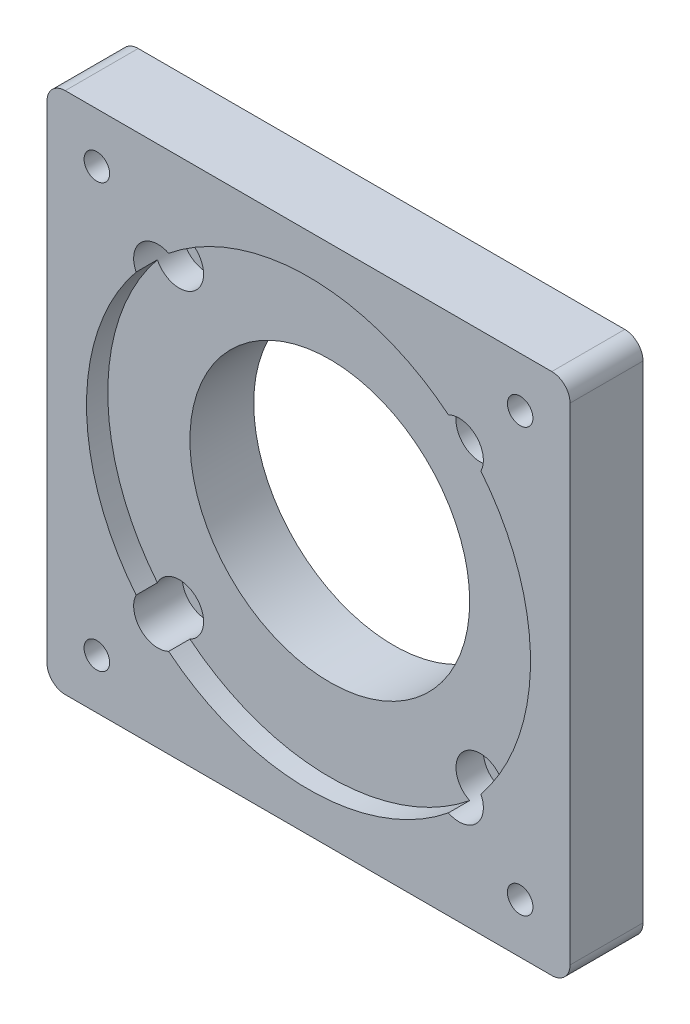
ISO-10303-21;
HEADER;
FILE_DESCRIPTION(('STEP AP214'),'2;1');
FILE_NAME('part.step','',(''),(''),'','','');
FILE_SCHEMA(('AUTOMOTIVE_DESIGN { 1 0 10303 214 1 1 1 1 }'));
ENDSEC;
DATA;
#1=APPLICATION_CONTEXT('core data for automotive mechanical design processes');
#2=APPLICATION_PROTOCOL_DEFINITION('international standard','automotive_design',2000,#1);
#3=PRODUCT_CONTEXT('',#1,'mechanical');
#4=PRODUCT('Part','Part','',(#3));
#5=PRODUCT_RELATED_PRODUCT_CATEGORY('part','',(#4));
#6=PRODUCT_DEFINITION_FORMATION('','',#4);
#7=PRODUCT_DEFINITION_CONTEXT('part definition',#1,'design');
#8=PRODUCT_DEFINITION('design','',#6,#7);
#9=PRODUCT_DEFINITION_SHAPE('','',#8);
#10=(LENGTH_UNIT() NAMED_UNIT(*) SI_UNIT(.MILLI.,.METRE.));
#11=(NAMED_UNIT(*) PLANE_ANGLE_UNIT() SI_UNIT($,.RADIAN.));
#12=(NAMED_UNIT(*) SI_UNIT($,.STERADIAN.) SOLID_ANGLE_UNIT());
#13=UNCERTAINTY_MEASURE_WITH_UNIT(LENGTH_MEASURE(1.E-05),#10,'distance_accuracy_value','');
#14=(GEOMETRIC_REPRESENTATION_CONTEXT(3) GLOBAL_UNCERTAINTY_ASSIGNED_CONTEXT((#13)) GLOBAL_UNIT_ASSIGNED_CONTEXT((#10,
#11,#12)) REPRESENTATION_CONTEXT('',''));
#15=CARTESIAN_POINT('',(0.,0.,0.));
#16=DIRECTION('',(0.,0.,1.));
#17=DIRECTION('',(1.,0.,0.));
#18=AXIS2_PLACEMENT_3D('',#15,#16,#17);
#19=CARTESIAN_POINT('',(40.,-40.,0.));
#20=DIRECTION('',(0.,0.,1.));
#21=DIRECTION('',(1.,0.,0.));
#22=AXIS2_PLACEMENT_3D('',#19,#20,#21);
#23=PLANE('',#22);
#24=CARTESIAN_POINT('',(40.,-40.,0.));
#25=DIRECTION('',(0.,0.,1.));
#26=DIRECTION('',(1.,0.,0.));
#27=AXIS2_PLACEMENT_3D('',#24,#25,#26);
#28=CIRCLE('',#27,2.99999999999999);
#29=CARTESIAN_POINT('',(40.,-43.,0.));
#30=VERTEX_POINT('',#29);
#31=CARTESIAN_POINT('',(43.,-40.,0.));
#32=VERTEX_POINT('',#31);
#33=EDGE_CURVE('E218',#30,#32,#28,.T.);
#34=ORIENTED_EDGE('',*,*,#33,.F.);
#35=DIRECTION('',(1.,0.,0.));
#36=VECTOR('',#35,1.);
#37=CARTESIAN_POINT('',(-40.,-43.,0.));
#38=LINE('',#37,#36);
#39=CARTESIAN_POINT('',(-40.,-43.,0.));
#40=VERTEX_POINT('',#39);
#41=EDGE_CURVE('E197',#40,#30,#38,.T.);
#42=ORIENTED_EDGE('',*,*,#41,.F.);
#43=CARTESIAN_POINT('',(-40.,-40.,0.));
#44=DIRECTION('',(0.,0.,1.));
#45=DIRECTION('',(1.,0.,0.));
#46=AXIS2_PLACEMENT_3D('',#43,#44,#45);
#47=CIRCLE('',#46,3.00000000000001);
#48=CARTESIAN_POINT('',(-43.,-40.,0.));
#49=VERTEX_POINT('',#48);
#50=EDGE_CURVE('E237',#49,#40,#47,.T.);
#51=ORIENTED_EDGE('',*,*,#50,.F.);
#52=DIRECTION('',(0.,-1.,0.));
#53=VECTOR('',#52,1.);
#54=CARTESIAN_POINT('',(-43.,40.,0.));
#55=LINE('',#54,#53);
#56=CARTESIAN_POINT('',(-43.,40.,0.));
#57=VERTEX_POINT('',#56);
#58=EDGE_CURVE('E234',#57,#49,#55,.T.);
#59=ORIENTED_EDGE('',*,*,#58,.F.);
#60=CARTESIAN_POINT('',(-40.,40.,0.));
#61=DIRECTION('',(0.,0.,1.));
#62=DIRECTION('',(1.,0.,0.));
#63=AXIS2_PLACEMENT_3D('',#60,#61,#62);
#64=CIRCLE('',#63,3.);
#65=CARTESIAN_POINT('',(-40.,43.,0.));
#66=VERTEX_POINT('',#65);
#67=EDGE_CURVE('E232',#66,#57,#64,.T.);
#68=ORIENTED_EDGE('',*,*,#67,.F.);
#69=DIRECTION('',(-1.,0.,0.));
#70=VECTOR('',#69,1.);
#71=CARTESIAN_POINT('',(-40.,43.,0.));
#72=LINE('',#71,#70);
#73=CARTESIAN_POINT('',(40.,43.,0.));
#74=VERTEX_POINT('',#73);
#75=EDGE_CURVE('E229',#74,#66,#72,.T.);
#76=ORIENTED_EDGE('',*,*,#75,.F.);
#77=CARTESIAN_POINT('',(40.,40.,0.));
#78=DIRECTION('',(0.,0.,1.));
#79=DIRECTION('',(-1.,0.,0.));
#80=AXIS2_PLACEMENT_3D('',#77,#78,#79);
#81=CIRCLE('',#80,3.00000000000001);
#82=CARTESIAN_POINT('',(43.,40.,0.));
#83=VERTEX_POINT('',#82);
#84=EDGE_CURVE('E226',#83,#74,#81,.T.);
#85=ORIENTED_EDGE('',*,*,#84,.F.);
#86=DIRECTION('',(0.,1.,0.));
#87=VECTOR('',#86,1.);
#88=CARTESIAN_POINT('',(43.,40.,0.));
#89=LINE('',#88,#87);
#90=EDGE_CURVE('E222',#32,#83,#89,.T.);
#91=ORIENTED_EDGE('',*,*,#90,.F.);
#92=EDGE_LOOP('',(#34,#42,#51,#59,#68,#76,#85,#91));
#93=FACE_BOUND('',#92,.T.);
#94=CARTESIAN_POINT('',(24.748737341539,-24.7487373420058,0.));
#95=DIRECTION('',(0.,0.,1.));
#96=DIRECTION('',(1.,0.,0.));
#97=AXIS2_PLACEMENT_3D('',#94,#95,#96);
#98=CIRCLE('',#97,2.25);
#99=CARTESIAN_POINT('',(26.998737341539,-24.7487373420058,0.));
#100=VERTEX_POINT('',#99);
#101=EDGE_CURVE('E364',#100,#100,#98,.T.);
#102=ORIENTED_EDGE('',*,*,#101,.T.);
#103=EDGE_LOOP('',(#102));
#104=FACE_BOUND('',#103,.T.);
#105=CARTESIAN_POINT('',(-24.7487373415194,-24.7487373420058,0.));
#106=DIRECTION('',(0.,0.,1.));
#107=DIRECTION('',(1.,0.,0.));
#108=AXIS2_PLACEMENT_3D('',#105,#106,#107);
#109=CIRCLE('',#108,2.25);
#110=CARTESIAN_POINT('',(-22.4987373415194,-24.7487373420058,0.));
#111=VERTEX_POINT('',#110);
#112=EDGE_CURVE('E329',#111,#111,#109,.T.);
#113=ORIENTED_EDGE('',*,*,#112,.T.);
#114=EDGE_LOOP('',(#113));
#115=FACE_BOUND('',#114,.T.);
#116=CARTESIAN_POINT('',(-24.7487373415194,24.7487373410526,0.));
#117=DIRECTION('',(0.,0.,1.));
#118=DIRECTION('',(1.,0.,0.));
#119=AXIS2_PLACEMENT_3D('',#116,#117,#118);
#120=CIRCLE('',#119,2.25);
#121=CARTESIAN_POINT('',(-22.4987373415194,24.7487373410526,0.));
#122=VERTEX_POINT('',#121);
#123=EDGE_CURVE('E344',#122,#122,#120,.T.);
#124=ORIENTED_EDGE('',*,*,#123,.T.);
#125=EDGE_LOOP('',(#124));
#126=FACE_BOUND('',#125,.T.);
#127=CARTESIAN_POINT('',(24.748737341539,24.7487373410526,0.));
#128=DIRECTION('',(0.,0.,1.));
#129=DIRECTION('',(1.,0.,0.));
#130=AXIS2_PLACEMENT_3D('',#127,#128,#129);
#131=CIRCLE('',#130,2.25);
#132=CARTESIAN_POINT('',(26.998737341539,24.7487373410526,0.));
#133=VERTEX_POINT('',#132);
#134=EDGE_CURVE('E493',#133,#133,#131,.T.);
#135=ORIENTED_EDGE('',*,*,#134,.T.);
#136=EDGE_LOOP('',(#135));
#137=FACE_BOUND('',#136,.T.);
#138=CARTESIAN_POINT('',(34.8,-34.8,0.));
#139=DIRECTION('',(0.,0.,1.));
#140=DIRECTION('',(1.,0.,0.));
#141=AXIS2_PLACEMENT_3D('',#138,#139,#140);
#142=CIRCLE('',#141,2.1);
#143=CARTESIAN_POINT('',(36.9,-34.8,0.));
#144=VERTEX_POINT('',#143);
#145=EDGE_CURVE('E165',#144,#144,#142,.T.);
#146=ORIENTED_EDGE('',*,*,#145,.T.);
#147=EDGE_LOOP('',(#146));
#148=FACE_BOUND('',#147,.T.);
#149=CARTESIAN_POINT('',(-34.8,-34.8,0.));
#150=DIRECTION('',(0.,0.,1.));
#151=DIRECTION('',(1.,0.,0.));
#152=AXIS2_PLACEMENT_3D('',#149,#150,#151);
#153=CIRCLE('',#152,2.1);
#154=CARTESIAN_POINT('',(-32.7,-34.8,0.));
#155=VERTEX_POINT('',#154);
#156=EDGE_CURVE('E477',#155,#155,#153,.T.);
#157=ORIENTED_EDGE('',*,*,#156,.T.);
#158=EDGE_LOOP('',(#157));
#159=FACE_BOUND('',#158,.T.);
#160=CARTESIAN_POINT('',(34.8,34.8,0.));
#161=DIRECTION('',(0.,0.,1.));
#162=DIRECTION('',(1.,0.,0.));
#163=AXIS2_PLACEMENT_3D('',#160,#161,#162);
#164=CIRCLE('',#163,2.1);
#165=CARTESIAN_POINT('',(36.9,34.8,0.));
#166=VERTEX_POINT('',#165);
#167=EDGE_CURVE('E855',#166,#166,#164,.T.);
#168=ORIENTED_EDGE('',*,*,#167,.T.);
#169=EDGE_LOOP('',(#168));
#170=FACE_BOUND('',#169,.T.);
#171=CARTESIAN_POINT('',(-34.8,34.8,0.));
#172=DIRECTION('',(0.,0.,1.));
#173=DIRECTION('',(1.,0.,0.));
#174=AXIS2_PLACEMENT_3D('',#171,#172,#173);
#175=CIRCLE('',#174,2.1);
#176=CARTESIAN_POINT('',(-32.7,34.8,0.));
#177=VERTEX_POINT('',#176);
#178=EDGE_CURVE('E850',#177,#177,#175,.T.);
#179=ORIENTED_EDGE('',*,*,#178,.T.);
#180=EDGE_LOOP('',(#179));
#181=FACE_BOUND('',#180,.T.);
#182=CARTESIAN_POINT('',(0.,0.,0.));
#183=DIRECTION('',(0.,0.,1.));
#184=DIRECTION('',(1.,0.,0.));
#185=AXIS2_PLACEMENT_3D('',#182,#183,#184);
#186=CIRCLE('',#185,25.);
#187=CARTESIAN_POINT('',(25.,0.,0.));
#188=VERTEX_POINT('',#187);
#189=EDGE_CURVE('E11',#188,#188,#186,.F.);
#190=ORIENTED_EDGE('',*,*,#189,.F.);
#191=EDGE_LOOP('',(#190));
#192=FACE_BOUND('',#191,.T.);
#193=ADVANCED_FACE('F42',(#93,#104,#115,#126,#137,#148,#159,#170,#181,#192),#23,.F.);
#194=CARTESIAN_POINT('',(0.,0.,8.5));
#195=DIRECTION('',(0.,0.,1.));
#196=DIRECTION('',(1.,0.,0.));
#197=AXIS2_PLACEMENT_3D('',#194,#195,#196);
#198=CYLINDRICAL_SURFACE('',#197,36.5);
#199=CARTESIAN_POINT('',(0.,0.,8.5));
#200=DIRECTION('',(0.,0.,1.));
#201=DIRECTION('',(1.,0.,0.));
#202=AXIS2_PLACEMENT_3D('',#199,#200,#201);
#203=CIRCLE('',#202,36.5);
#204=CARTESIAN_POINT('',(22.9964875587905,28.3445155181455,8.5));
#205=VERTEX_POINT('',#204);
#206=CARTESIAN_POINT('',(-22.9964875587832,28.3445155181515,8.5));
#207=VERTEX_POINT('',#206);
#208=EDGE_CURVE('E65',#205,#207,#203,.T.);
#209=ORIENTED_EDGE('',*,*,#208,.F.);
#210=DIRECTION('',(0.,0.,1.));
#211=VECTOR('',#210,1.);
#212=CARTESIAN_POINT('',(22.9964875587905,28.3445155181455,8.));
#213=LINE('',#212,#211);
#214=CARTESIAN_POINT('',(22.9964875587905,28.3445155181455,12.));
#215=VERTEX_POINT('',#214);
#216=EDGE_CURVE('E51',#205,#215,#213,.T.);
#217=ORIENTED_EDGE('',*,*,#216,.T.);
#218=CARTESIAN_POINT('',(0.,0.,12.));
#219=DIRECTION('',(0.,0.,1.));
#220=DIRECTION('',(1.,0.,0.));
#221=AXIS2_PLACEMENT_3D('',#218,#219,#220);
#222=CIRCLE('',#221,36.5);
#223=CARTESIAN_POINT('',(-22.9964875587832,28.3445155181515,12.));
#224=VERTEX_POINT('',#223);
#225=EDGE_CURVE('E170',#215,#224,#222,.T.);
#226=ORIENTED_EDGE('',*,*,#225,.T.);
#227=DIRECTION('',(0.,0.,1.));
#228=VECTOR('',#227,1.);
#229=CARTESIAN_POINT('',(-22.9964875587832,28.3445155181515,8.));
#230=LINE('',#229,#228);
#231=EDGE_CURVE('E292',#224,#207,#230,.F.);
#232=ORIENTED_EDGE('',*,*,#231,.T.);
#233=EDGE_LOOP('',(#209,#217,#226,#232));
#234=FACE_BOUND('',#233,.T.);
#235=ADVANCED_FACE('F168',(#234),#198,.F.);
#236=CARTESIAN_POINT('',(-28.3445155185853,22.9964875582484,8.5));
#237=VERTEX_POINT('',#236);
#238=CARTESIAN_POINT('',(-28.3445155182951,-22.9964875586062,8.5));
#239=VERTEX_POINT('',#238);
#240=EDGE_CURVE('E313',#237,#239,#203,.T.);
#241=ORIENTED_EDGE('',*,*,#240,.F.);
#242=DIRECTION('',(0.,0.,1.));
#243=VECTOR('',#242,1.);
#244=CARTESIAN_POINT('',(-28.3445155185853,22.9964875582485,8.));
#245=LINE('',#244,#243);
#246=CARTESIAN_POINT('',(-28.3445155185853,22.9964875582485,12.));
#247=VERTEX_POINT('',#246);
#248=EDGE_CURVE('E295',#237,#247,#245,.T.);
#249=ORIENTED_EDGE('',*,*,#248,.T.);
#250=CARTESIAN_POINT('',(-28.3445155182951,-22.9964875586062,12.));
#251=VERTEX_POINT('',#250);
#252=EDGE_CURVE('E180',#247,#251,#222,.T.);
#253=ORIENTED_EDGE('',*,*,#252,.T.);
#254=DIRECTION('',(0.,0.,1.));
#255=VECTOR('',#254,1.);
#256=CARTESIAN_POINT('',(-28.3445155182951,-22.9964875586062,8.));
#257=LINE('',#256,#255);
#258=EDGE_CURVE('E284',#251,#239,#257,.F.);
#259=ORIENTED_EDGE('',*,*,#258,.T.);
#260=EDGE_LOOP('',(#241,#249,#253,#259));
#261=FACE_BOUND('',#260,.T.);
#262=ADVANCED_FACE('F331',(#261),#198,.F.);
#263=CARTESIAN_POINT('',(-22.9964875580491,-28.3445155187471,8.5));
#264=VERTEX_POINT('',#263);
#265=CARTESIAN_POINT('',(22.9964875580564,-28.3445155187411,8.5));
#266=VERTEX_POINT('',#265);
#267=EDGE_CURVE('E185',#264,#266,#203,.T.);
#268=ORIENTED_EDGE('',*,*,#267,.F.);
#269=DIRECTION('',(0.,0.,1.));
#270=VECTOR('',#269,1.);
#271=CARTESIAN_POINT('',(-22.9964875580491,-28.344515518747,8.));
#272=LINE('',#271,#270);
#273=CARTESIAN_POINT('',(-22.9964875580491,-28.344515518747,12.));
#274=VERTEX_POINT('',#273);
#275=EDGE_CURVE('E288',#264,#274,#272,.T.);
#276=ORIENTED_EDGE('',*,*,#275,.T.);
#277=CARTESIAN_POINT('',(22.9964875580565,-28.3445155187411,12.));
#278=VERTEX_POINT('',#277);
#279=EDGE_CURVE('E186',#274,#278,#222,.T.);
#280=ORIENTED_EDGE('',*,*,#279,.T.);
#281=DIRECTION('',(0.,0.,1.));
#282=VECTOR('',#281,1.);
#283=CARTESIAN_POINT('',(22.9964875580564,-28.3445155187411,8.));
#284=LINE('',#283,#282);
#285=EDGE_CURVE('E273',#278,#266,#284,.F.);
#286=ORIENTED_EDGE('',*,*,#285,.T.);
#287=EDGE_LOOP('',(#268,#276,#280,#286));
#288=FACE_BOUND('',#287,.T.);
#289=ADVANCED_FACE('F374',(#288),#198,.F.);
#290=CARTESIAN_POINT('',(0.,0.,0.));
#291=DIRECTION('',(0.,0.,1.));
#292=DIRECTION('',(1.,0.,0.));
#293=AXIS2_PLACEMENT_3D('',#290,#291,#292);
#294=CYLINDRICAL_SURFACE('',#293,23.);
#295=CARTESIAN_POINT('',(0.,0.,8.5));
#296=DIRECTION('',(0.,0.,1.));
#297=DIRECTION('',(1.,0.,0.));
#298=AXIS2_PLACEMENT_3D('',#295,#296,#297);
#299=CIRCLE('',#298,23.);
#300=CARTESIAN_POINT('',(23.,0.,8.5));
#301=VERTEX_POINT('',#300);
#302=EDGE_CURVE('E223',#301,#301,#299,.F.);
#303=ORIENTED_EDGE('',*,*,#302,.F.);
#304=EDGE_LOOP('',(#303));
#305=FACE_BOUND('',#304,.T.);
#306=CARTESIAN_POINT('',(0.,0.,-2.));
#307=DIRECTION('',(0.,0.,-1.));
#308=DIRECTION('',(-1.,0.,0.));
#309=AXIS2_PLACEMENT_3D('',#306,#307,#308);
#310=CIRCLE('',#309,23.);
#311=CARTESIAN_POINT('',(-23.,0.,-2.));
#312=VERTEX_POINT('',#311);
#313=EDGE_CURVE('E840',#312,#312,#310,.T.);
#314=ORIENTED_EDGE('',*,*,#313,.T.);
#315=EDGE_LOOP('',(#314));
#316=FACE_BOUND('',#315,.T.);
#317=ADVANCED_FACE('F431',(#305,#316),#294,.F.);
#318=CARTESIAN_POINT('',(40.,-40.,12.));
#319=DIRECTION('',(0.,0.,-1.));
#320=DIRECTION('',(-1.,0.,0.));
#321=AXIS2_PLACEMENT_3D('',#318,#319,#320);
#322=CYLINDRICAL_SURFACE('',#321,2.99999999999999);
#323=ORIENTED_EDGE('',*,*,#33,.T.);
#324=DIRECTION('',(0.,0.,-1.));
#325=VECTOR('',#324,1.);
#326=CARTESIAN_POINT('',(43.,-40.,12.));
#327=LINE('',#326,#325);
#328=CARTESIAN_POINT('',(43.,-40.,12.));
#329=VERTEX_POINT('',#328);
#330=EDGE_CURVE('E269',#329,#32,#327,.T.);
#331=ORIENTED_EDGE('',*,*,#330,.F.);
#332=CARTESIAN_POINT('',(40.,-40.,12.));
#333=DIRECTION('',(0.,0.,1.));
#334=DIRECTION('',(1.,0.,0.));
#335=AXIS2_PLACEMENT_3D('',#332,#333,#334);
#336=CIRCLE('',#335,2.99999999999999);
#337=CARTESIAN_POINT('',(40.,-43.,12.));
#338=VERTEX_POINT('',#337);
#339=EDGE_CURVE('E192',#338,#329,#336,.T.);
#340=ORIENTED_EDGE('',*,*,#339,.F.);
#341=DIRECTION('',(0.,0.,-1.));
#342=VECTOR('',#341,1.);
#343=CARTESIAN_POINT('',(40.,-43.,12.));
#344=LINE('',#343,#342);
#345=EDGE_CURVE('E217',#338,#30,#344,.T.);
#346=ORIENTED_EDGE('',*,*,#345,.T.);
#347=EDGE_LOOP('',(#323,#331,#340,#346));
#348=FACE_BOUND('',#347,.T.);
#349=ADVANCED_FACE('F44',(#348),#322,.T.);
#350=CARTESIAN_POINT('',(43.,40.,12.));
#351=DIRECTION('',(-1.,0.,0.));
#352=DIRECTION('',(0.,0.,1.));
#353=AXIS2_PLACEMENT_3D('',#350,#351,#352);
#354=PLANE('',#353);
#355=ORIENTED_EDGE('',*,*,#90,.T.);
#356=DIRECTION('',(0.,0.,-1.));
#357=VECTOR('',#356,1.);
#358=CARTESIAN_POINT('',(43.,40.,12.));
#359=LINE('',#358,#357);
#360=CARTESIAN_POINT('',(43.,40.,12.));
#361=VERTEX_POINT('',#360);
#362=EDGE_CURVE('E265',#361,#83,#359,.T.);
#363=ORIENTED_EDGE('',*,*,#362,.F.);
#364=DIRECTION('',(0.,1.,0.));
#365=VECTOR('',#364,1.);
#366=CARTESIAN_POINT('',(43.,40.,12.));
#367=LINE('',#366,#365);
#368=EDGE_CURVE('E196',#329,#361,#367,.T.);
#369=ORIENTED_EDGE('',*,*,#368,.F.);
#370=ORIENTED_EDGE('',*,*,#330,.T.);
#371=EDGE_LOOP('',(#355,#363,#369,#370));
#372=FACE_BOUND('',#371,.T.);
#373=ADVANCED_FACE('F424',(#372),#354,.F.);
#374=CARTESIAN_POINT('',(40.,40.,12.));
#375=DIRECTION('',(0.,0.,-1.));
#376=DIRECTION('',(-1.,0.,0.));
#377=AXIS2_PLACEMENT_3D('',#374,#375,#376);
#378=CYLINDRICAL_SURFACE('',#377,3.00000000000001);
#379=ORIENTED_EDGE('',*,*,#84,.T.);
#380=DIRECTION('',(0.,0.,-1.));
#381=VECTOR('',#380,1.);
#382=CARTESIAN_POINT('',(40.,43.,12.));
#383=LINE('',#382,#381);
#384=CARTESIAN_POINT('',(40.,43.,12.));
#385=VERTEX_POINT('',#384);
#386=EDGE_CURVE('E261',#385,#74,#383,.T.);
#387=ORIENTED_EDGE('',*,*,#386,.F.);
#388=CARTESIAN_POINT('',(40.,40.,12.));
#389=DIRECTION('',(0.,0.,1.));
#390=DIRECTION('',(-1.,0.,0.));
#391=AXIS2_PLACEMENT_3D('',#388,#389,#390);
#392=CIRCLE('',#391,3.00000000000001);
#393=EDGE_CURVE('E200',#361,#385,#392,.T.);
#394=ORIENTED_EDGE('',*,*,#393,.F.);
#395=ORIENTED_EDGE('',*,*,#362,.T.);
#396=EDGE_LOOP('',(#379,#387,#394,#395));
#397=FACE_BOUND('',#396,.T.);
#398=ADVANCED_FACE('F421',(#397),#378,.T.);
#399=CARTESIAN_POINT('',(-40.,43.,12.));
#400=DIRECTION('',(0.,-1.,0.));
#401=DIRECTION('',(1.,0.,0.));
#402=AXIS2_PLACEMENT_3D('',#399,#400,#401);
#403=PLANE('',#402);
#404=ORIENTED_EDGE('',*,*,#75,.T.);
#405=DIRECTION('',(0.,0.,-1.));
#406=VECTOR('',#405,1.);
#407=CARTESIAN_POINT('',(-40.,43.,12.));
#408=LINE('',#407,#406);
#409=CARTESIAN_POINT('',(-40.,43.,12.));
#410=VERTEX_POINT('',#409);
#411=EDGE_CURVE('E257',#410,#66,#408,.T.);
#412=ORIENTED_EDGE('',*,*,#411,.F.);
#413=DIRECTION('',(-1.,0.,0.));
#414=VECTOR('',#413,1.);
#415=CARTESIAN_POINT('',(-40.,43.,12.));
#416=LINE('',#415,#414);
#417=EDGE_CURVE('E202',#385,#410,#416,.T.);
#418=ORIENTED_EDGE('',*,*,#417,.F.);
#419=ORIENTED_EDGE('',*,*,#386,.T.);
#420=EDGE_LOOP('',(#404,#412,#418,#419));
#421=FACE_BOUND('',#420,.T.);
#422=ADVANCED_FACE('F417',(#421),#403,.F.);
#423=CARTESIAN_POINT('',(-40.,40.,12.));
#424=DIRECTION('',(0.,0.,-1.));
#425=DIRECTION('',(-1.,0.,0.));
#426=AXIS2_PLACEMENT_3D('',#423,#424,#425);
#427=CYLINDRICAL_SURFACE('',#426,3.);
#428=ORIENTED_EDGE('',*,*,#67,.T.);
#429=DIRECTION('',(0.,0.,-1.));
#430=VECTOR('',#429,1.);
#431=CARTESIAN_POINT('',(-43.,40.,12.));
#432=LINE('',#431,#430);
#433=CARTESIAN_POINT('',(-43.,40.,12.));
#434=VERTEX_POINT('',#433);
#435=EDGE_CURVE('E253',#434,#57,#432,.T.);
#436=ORIENTED_EDGE('',*,*,#435,.F.);
#437=CARTESIAN_POINT('',(-40.,40.,12.));
#438=DIRECTION('',(0.,0.,1.));
#439=DIRECTION('',(1.,0.,0.));
#440=AXIS2_PLACEMENT_3D('',#437,#438,#439);
#441=CIRCLE('',#440,3.);
#442=EDGE_CURVE('E205',#410,#434,#441,.T.);
#443=ORIENTED_EDGE('',*,*,#442,.F.);
#444=ORIENTED_EDGE('',*,*,#411,.T.);
#445=EDGE_LOOP('',(#428,#436,#443,#444));
#446=FACE_BOUND('',#445,.T.);
#447=ADVANCED_FACE('F413',(#446),#427,.T.);
#448=CARTESIAN_POINT('',(-43.,40.,12.));
#449=DIRECTION('',(1.,0.,0.));
#450=DIRECTION('',(0.,0.,-1.));
#451=AXIS2_PLACEMENT_3D('',#448,#449,#450);
#452=PLANE('',#451);
#453=ORIENTED_EDGE('',*,*,#58,.T.);
#454=DIRECTION('',(0.,0.,-1.));
#455=VECTOR('',#454,1.);
#456=CARTESIAN_POINT('',(-43.,-40.,12.));
#457=LINE('',#456,#455);
#458=CARTESIAN_POINT('',(-43.,-40.,12.));
#459=VERTEX_POINT('',#458);
#460=EDGE_CURVE('E249',#459,#49,#457,.T.);
#461=ORIENTED_EDGE('',*,*,#460,.F.);
#462=DIRECTION('',(0.,-1.,0.));
#463=VECTOR('',#462,1.);
#464=CARTESIAN_POINT('',(-43.,40.,12.));
#465=LINE('',#464,#463);
#466=EDGE_CURVE('E208',#434,#459,#465,.T.);
#467=ORIENTED_EDGE('',*,*,#466,.F.);
#468=ORIENTED_EDGE('',*,*,#435,.T.);
#469=EDGE_LOOP('',(#453,#461,#467,#468));
#470=FACE_BOUND('',#469,.T.);
#471=ADVANCED_FACE('F409',(#470),#452,.F.);
#472=CARTESIAN_POINT('',(-40.,-40.,12.));
#473=DIRECTION('',(0.,0.,-1.));
#474=DIRECTION('',(-1.,0.,0.));
#475=AXIS2_PLACEMENT_3D('',#472,#473,#474);
#476=CYLINDRICAL_SURFACE('',#475,3.00000000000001);
#477=ORIENTED_EDGE('',*,*,#50,.T.);
#478=DIRECTION('',(0.,0.,-1.));
#479=VECTOR('',#478,1.);
#480=CARTESIAN_POINT('',(-40.,-43.,12.));
#481=LINE('',#480,#479);
#482=CARTESIAN_POINT('',(-40.,-43.,12.));
#483=VERTEX_POINT('',#482);
#484=EDGE_CURVE('E245',#483,#40,#481,.T.);
#485=ORIENTED_EDGE('',*,*,#484,.F.);
#486=CARTESIAN_POINT('',(-40.,-40.,12.));
#487=DIRECTION('',(0.,0.,1.));
#488=DIRECTION('',(1.,0.,0.));
#489=AXIS2_PLACEMENT_3D('',#486,#487,#488);
#490=CIRCLE('',#489,3.00000000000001);
#491=EDGE_CURVE('E211',#459,#483,#490,.T.);
#492=ORIENTED_EDGE('',*,*,#491,.F.);
#493=ORIENTED_EDGE('',*,*,#460,.T.);
#494=EDGE_LOOP('',(#477,#485,#492,#493));
#495=FACE_BOUND('',#494,.T.);
#496=ADVANCED_FACE('F405',(#495),#476,.T.);
#497=CARTESIAN_POINT('',(-40.,-43.,12.));
#498=DIRECTION('',(0.,1.,0.));
#499=DIRECTION('',(0.,0.,1.));
#500=AXIS2_PLACEMENT_3D('',#497,#498,#499);
#501=PLANE('',#500);
#502=ORIENTED_EDGE('',*,*,#41,.T.);
#503=ORIENTED_EDGE('',*,*,#345,.F.);
#504=DIRECTION('',(1.,0.,0.));
#505=VECTOR('',#504,1.);
#506=CARTESIAN_POINT('',(-40.,-43.,12.));
#507=LINE('',#506,#505);
#508=EDGE_CURVE('E214',#483,#338,#507,.T.);
#509=ORIENTED_EDGE('',*,*,#508,.F.);
#510=ORIENTED_EDGE('',*,*,#484,.T.);
#511=EDGE_LOOP('',(#502,#503,#509,#510));
#512=FACE_BOUND('',#511,.T.);
#513=ADVANCED_FACE('F402',(#512),#501,.F.);
#514=CARTESIAN_POINT('',(40.,-40.,12.));
#515=DIRECTION('',(0.,0.,1.));
#516=DIRECTION('',(1.,0.,0.));
#517=AXIS2_PLACEMENT_3D('',#514,#515,#516);
#518=PLANE('',#517);
#519=CARTESIAN_POINT('',(-34.8,34.8,12.));
#520=DIRECTION('',(0.,0.,1.));
#521=DIRECTION('',(1.,0.,0.));
#522=AXIS2_PLACEMENT_3D('',#519,#520,#521);
#523=CIRCLE('',#522,2.1);
#524=CARTESIAN_POINT('',(-32.7,34.8,12.));
#525=VERTEX_POINT('',#524);
#526=EDGE_CURVE('E463',#525,#525,#523,.T.);
#527=ORIENTED_EDGE('',*,*,#526,.F.);
#528=EDGE_LOOP('',(#527));
#529=FACE_BOUND('',#528,.T.);
#530=CARTESIAN_POINT('',(34.8,34.8,12.));
#531=DIRECTION('',(0.,0.,1.));
#532=DIRECTION('',(1.,0.,0.));
#533=AXIS2_PLACEMENT_3D('',#530,#531,#532);
#534=CIRCLE('',#533,2.1);
#535=CARTESIAN_POINT('',(36.9,34.8,12.));
#536=VERTEX_POINT('',#535);
#537=EDGE_CURVE('E467',#536,#536,#534,.T.);
#538=ORIENTED_EDGE('',*,*,#537,.F.);
#539=EDGE_LOOP('',(#538));
#540=FACE_BOUND('',#539,.T.);
#541=CARTESIAN_POINT('',(-34.8,-34.8,12.));
#542=DIRECTION('',(0.,0.,1.));
#543=DIRECTION('',(1.,0.,0.));
#544=AXIS2_PLACEMENT_3D('',#541,#542,#543);
#545=CIRCLE('',#544,2.1);
#546=CARTESIAN_POINT('',(-32.7,-34.8,12.));
#547=VERTEX_POINT('',#546);
#548=EDGE_CURVE('E471',#547,#547,#545,.T.);
#549=ORIENTED_EDGE('',*,*,#548,.F.);
#550=EDGE_LOOP('',(#549));
#551=FACE_BOUND('',#550,.T.);
#552=CARTESIAN_POINT('',(34.8,-34.8,12.));
#553=DIRECTION('',(0.,0.,1.));
#554=DIRECTION('',(1.,0.,0.));
#555=AXIS2_PLACEMENT_3D('',#552,#553,#554);
#556=CIRCLE('',#555,2.1);
#557=CARTESIAN_POINT('',(36.9,-34.8,12.));
#558=VERTEX_POINT('',#557);
#559=EDGE_CURVE('E474',#558,#558,#556,.T.);
#560=ORIENTED_EDGE('',*,*,#559,.F.);
#561=EDGE_LOOP('',(#560));
#562=FACE_BOUND('',#561,.T.);
#563=CARTESIAN_POINT('',(24.748737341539,24.7487373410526,12.));
#564=DIRECTION('',(0.,0.,1.));
#565=DIRECTION('',(1.,0.,0.));
#566=AXIS2_PLACEMENT_3D('',#563,#564,#565);
#567=CIRCLE('',#566,4.);
#568=CARTESIAN_POINT('',(28.3445155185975,22.9964875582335,12.));
#569=VERTEX_POINT('',#568);
#570=EDGE_CURVE('E155',#569,#215,#567,.T.);
#571=ORIENTED_EDGE('',*,*,#570,.F.);
#572=CARTESIAN_POINT('',(28.3445155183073,-22.9964875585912,12.));
#573=VERTEX_POINT('',#572);
#574=EDGE_CURVE('E179',#573,#569,#222,.T.);
#575=ORIENTED_EDGE('',*,*,#574,.F.);
#576=CARTESIAN_POINT('',(24.748737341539,-24.7487373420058,12.));
#577=DIRECTION('',(0.,0.,1.));
#578=DIRECTION('',(1.,0.,0.));
#579=AXIS2_PLACEMENT_3D('',#576,#577,#578);
#580=CIRCLE('',#579,4.);
#581=EDGE_CURVE('E328',#278,#573,#580,.T.);
#582=ORIENTED_EDGE('',*,*,#581,.F.);
#583=ORIENTED_EDGE('',*,*,#279,.F.);
#584=CARTESIAN_POINT('',(-24.7487373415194,-24.7487373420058,12.));
#585=DIRECTION('',(0.,0.,1.));
#586=DIRECTION('',(1.,0.,0.));
#587=AXIS2_PLACEMENT_3D('',#584,#585,#586);
#588=CIRCLE('',#587,4.);
#589=EDGE_CURVE('E333',#251,#274,#588,.T.);
#590=ORIENTED_EDGE('',*,*,#589,.F.);
#591=ORIENTED_EDGE('',*,*,#252,.F.);
#592=CARTESIAN_POINT('',(-24.7487373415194,24.7487373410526,12.));
#593=DIRECTION('',(0.,0.,1.));
#594=DIRECTION('',(1.,0.,0.));
#595=AXIS2_PLACEMENT_3D('',#592,#593,#594);
#596=CIRCLE('',#595,4.);
#597=EDGE_CURVE('E177',#224,#247,#596,.T.);
#598=ORIENTED_EDGE('',*,*,#597,.F.);
#599=ORIENTED_EDGE('',*,*,#225,.F.);
#600=EDGE_LOOP('',(#571,#575,#582,#583,#590,#591,#598,#599));
#601=FACE_BOUND('',#600,.T.);
#602=ORIENTED_EDGE('',*,*,#339,.T.);
#603=ORIENTED_EDGE('',*,*,#368,.T.);
#604=ORIENTED_EDGE('',*,*,#393,.T.);
#605=ORIENTED_EDGE('',*,*,#417,.T.);
#606=ORIENTED_EDGE('',*,*,#442,.T.);
#607=ORIENTED_EDGE('',*,*,#466,.T.);
#608=ORIENTED_EDGE('',*,*,#491,.T.);
#609=ORIENTED_EDGE('',*,*,#508,.T.);
#610=EDGE_LOOP('',(#602,#603,#604,#605,#606,#607,#608,#609));
#611=FACE_BOUND('',#610,.T.);
#612=ADVANCED_FACE('F174',(#529,#540,#551,#562,#601,#611),#518,.T.);
#613=CARTESIAN_POINT('',(0.,0.,8.5));
#614=DIRECTION('',(0.,0.,1.));
#615=DIRECTION('',(1.,0.,0.));
#616=AXIS2_PLACEMENT_3D('',#613,#614,#615);
#617=PLANE('',#616);
#618=CARTESIAN_POINT('',(24.748737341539,24.7487373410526,8.5));
#619=DIRECTION('',(0.,0.,1.));
#620=DIRECTION('',(1.,0.,0.));
#621=AXIS2_PLACEMENT_3D('',#618,#619,#620);
#622=CIRCLE('',#621,4.);
#623=CARTESIAN_POINT('',(28.3445155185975,22.9964875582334,8.5));
#624=VERTEX_POINT('',#623);
#625=EDGE_CURVE('E58',#205,#624,#622,.T.);
#626=ORIENTED_EDGE('',*,*,#625,.F.);
#627=ORIENTED_EDGE('',*,*,#208,.T.);
#628=CARTESIAN_POINT('',(-24.7487373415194,24.7487373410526,8.5));
#629=DIRECTION('',(0.,0.,1.));
#630=DIRECTION('',(1.,0.,0.));
#631=AXIS2_PLACEMENT_3D('',#628,#629,#630);
#632=CIRCLE('',#631,4.);
#633=EDGE_CURVE('E321',#237,#207,#632,.T.);
#634=ORIENTED_EDGE('',*,*,#633,.F.);
#635=ORIENTED_EDGE('',*,*,#240,.T.);
#636=CARTESIAN_POINT('',(-24.7487373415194,-24.7487373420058,8.5));
#637=DIRECTION('',(0.,0.,1.));
#638=DIRECTION('',(1.,0.,0.));
#639=AXIS2_PLACEMENT_3D('',#636,#637,#638);
#640=CIRCLE('',#639,4.);
#641=EDGE_CURVE('E320',#264,#239,#640,.T.);
#642=ORIENTED_EDGE('',*,*,#641,.F.);
#643=ORIENTED_EDGE('',*,*,#267,.T.);
#644=CARTESIAN_POINT('',(24.748737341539,-24.7487373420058,8.5));
#645=DIRECTION('',(0.,0.,1.));
#646=DIRECTION('',(1.,0.,0.));
#647=AXIS2_PLACEMENT_3D('',#644,#645,#646);
#648=CIRCLE('',#647,4.);
#649=CARTESIAN_POINT('',(28.3445155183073,-22.9964875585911,8.5));
#650=VERTEX_POINT('',#649);
#651=EDGE_CURVE('E310',#650,#266,#648,.T.);
#652=ORIENTED_EDGE('',*,*,#651,.F.);
#653=EDGE_CURVE('E190',#650,#624,#203,.T.);
#654=ORIENTED_EDGE('',*,*,#653,.T.);
#655=EDGE_LOOP('',(#626,#627,#634,#635,#642,#643,#652,#654));
#656=FACE_BOUND('',#655,.T.);
#657=ORIENTED_EDGE('',*,*,#302,.T.);
#658=EDGE_LOOP('',(#657));
#659=FACE_BOUND('',#658,.T.);
#660=ADVANCED_FACE('F307',(#656,#659),#617,.T.);
#661=ORIENTED_EDGE('',*,*,#574,.T.);
#662=DIRECTION('',(0.,0.,1.));
#663=VECTOR('',#662,1.);
#664=CARTESIAN_POINT('',(28.3445155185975,22.9964875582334,8.));
#665=LINE('',#664,#663);
#666=EDGE_CURVE('E158',#569,#624,#665,.F.);
#667=ORIENTED_EDGE('',*,*,#666,.T.);
#668=ORIENTED_EDGE('',*,*,#653,.F.);
#669=DIRECTION('',(0.,0.,1.));
#670=VECTOR('',#669,1.);
#671=CARTESIAN_POINT('',(28.3445155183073,-22.9964875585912,8.));
#672=LINE('',#671,#670);
#673=EDGE_CURVE('E280',#650,#573,#672,.T.);
#674=ORIENTED_EDGE('',*,*,#673,.T.);
#675=EDGE_LOOP('',(#661,#667,#668,#674));
#676=FACE_BOUND('',#675,.T.);
#677=ADVANCED_FACE('F305',(#676),#198,.F.);
#678=CARTESIAN_POINT('',(24.748737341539,-24.7487373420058,12.));
#679=DIRECTION('',(0.,0.,1.));
#680=DIRECTION('',(1.,0.,0.));
#681=AXIS2_PLACEMENT_3D('',#678,#679,#680);
#682=CYLINDRICAL_SURFACE('',#681,4.);
#683=CARTESIAN_POINT('',(24.748737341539,-24.7487373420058,4.));
#684=DIRECTION('',(0.,0.,1.));
#685=DIRECTION('',(1.,0.,0.));
#686=AXIS2_PLACEMENT_3D('',#683,#684,#685);
#687=CIRCLE('',#686,4.);
#688=CARTESIAN_POINT('',(28.748737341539,-24.7487373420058,4.));
#689=VERTEX_POINT('',#688);
#690=EDGE_CURVE('E356',#689,#689,#687,.T.);
#691=ORIENTED_EDGE('',*,*,#690,.F.);
#692=EDGE_LOOP('',(#691));
#693=FACE_BOUND('',#692,.T.);
#694=ORIENTED_EDGE('',*,*,#651,.T.);
#695=ORIENTED_EDGE('',*,*,#285,.F.);
#696=ORIENTED_EDGE('',*,*,#581,.T.);
#697=ORIENTED_EDGE('',*,*,#673,.F.);
#698=EDGE_LOOP('',(#694,#695,#696,#697));
#699=FACE_BOUND('',#698,.T.);
#700=ADVANCED_FACE('F375',(#693,#699),#682,.F.);
#701=CARTESIAN_POINT('',(24.748737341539,-24.7487373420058,12.));
#702=DIRECTION('',(0.,0.,1.));
#703=DIRECTION('',(1.,0.,0.));
#704=AXIS2_PLACEMENT_3D('',#701,#702,#703);
#705=CYLINDRICAL_SURFACE('',#704,2.25);
#706=ORIENTED_EDGE('',*,*,#101,.F.);
#707=EDGE_LOOP('',(#706));
#708=FACE_BOUND('',#707,.T.);
#709=CARTESIAN_POINT('',(24.748737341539,-24.7487373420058,4.));
#710=DIRECTION('',(0.,0.,1.));
#711=DIRECTION('',(1.,0.,0.));
#712=AXIS2_PLACEMENT_3D('',#709,#710,#711);
#713=CIRCLE('',#712,2.25);
#714=CARTESIAN_POINT('',(26.998737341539,-24.7487373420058,4.));
#715=VERTEX_POINT('',#714);
#716=EDGE_CURVE('E360',#715,#715,#713,.T.);
#717=ORIENTED_EDGE('',*,*,#716,.T.);
#718=EDGE_LOOP('',(#717));
#719=FACE_BOUND('',#718,.T.);
#720=ADVANCED_FACE('F377',(#708,#719),#705,.F.);
#721=CARTESIAN_POINT('',(26.998737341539,-24.7487373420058,4.));
#722=DIRECTION('',(0.,0.,-1.));
#723=DIRECTION('',(-1.,0.,0.));
#724=AXIS2_PLACEMENT_3D('',#721,#722,#723);
#725=PLANE('',#724);
#726=ORIENTED_EDGE('',*,*,#716,.F.);
#727=EDGE_LOOP('',(#726));
#728=FACE_BOUND('',#727,.T.);
#729=ORIENTED_EDGE('',*,*,#690,.T.);
#730=EDGE_LOOP('',(#729));
#731=FACE_BOUND('',#730,.T.);
#732=ADVANCED_FACE('F384',(#728,#731),#725,.F.);
#733=CARTESIAN_POINT('',(-24.7487373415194,-24.7487373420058,12.));
#734=DIRECTION('',(0.,0.,1.));
#735=DIRECTION('',(1.,0.,0.));
#736=AXIS2_PLACEMENT_3D('',#733,#734,#735);
#737=CYLINDRICAL_SURFACE('',#736,4.);
#738=CARTESIAN_POINT('',(-24.7487373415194,-24.7487373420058,4.));
#739=DIRECTION('',(0.,0.,1.));
#740=DIRECTION('',(1.,0.,0.));
#741=AXIS2_PLACEMENT_3D('',#738,#739,#740);
#742=CIRCLE('',#741,4.);
#743=CARTESIAN_POINT('',(-20.7487373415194,-24.7487373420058,4.));
#744=VERTEX_POINT('',#743);
#745=EDGE_CURVE('E336',#744,#744,#742,.T.);
#746=ORIENTED_EDGE('',*,*,#745,.F.);
#747=EDGE_LOOP('',(#746));
#748=FACE_BOUND('',#747,.T.);
#749=ORIENTED_EDGE('',*,*,#641,.T.);
#750=ORIENTED_EDGE('',*,*,#258,.F.);
#751=ORIENTED_EDGE('',*,*,#589,.T.);
#752=ORIENTED_EDGE('',*,*,#275,.F.);
#753=EDGE_LOOP('',(#749,#750,#751,#752));
#754=FACE_BOUND('',#753,.T.);
#755=ADVANCED_FACE('F325',(#748,#754),#737,.F.);
#756=CARTESIAN_POINT('',(-24.7487373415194,-24.7487373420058,12.));
#757=DIRECTION('',(0.,0.,1.));
#758=DIRECTION('',(1.,0.,0.));
#759=AXIS2_PLACEMENT_3D('',#756,#757,#758);
#760=CYLINDRICAL_SURFACE('',#759,2.25);
#761=ORIENTED_EDGE('',*,*,#112,.F.);
#762=EDGE_LOOP('',(#761));
#763=FACE_BOUND('',#762,.T.);
#764=CARTESIAN_POINT('',(-24.7487373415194,-24.7487373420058,4.));
#765=DIRECTION('',(0.,0.,1.));
#766=DIRECTION('',(1.,0.,0.));
#767=AXIS2_PLACEMENT_3D('',#764,#765,#766);
#768=CIRCLE('',#767,2.25);
#769=CARTESIAN_POINT('',(-22.4987373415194,-24.7487373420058,4.));
#770=VERTEX_POINT('',#769);
#771=EDGE_CURVE('E341',#770,#770,#768,.T.);
#772=ORIENTED_EDGE('',*,*,#771,.T.);
#773=EDGE_LOOP('',(#772));
#774=FACE_BOUND('',#773,.T.);
#775=ADVANCED_FACE('F532',(#763,#774),#760,.F.);
#776=CARTESIAN_POINT('',(-22.4987373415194,-24.7487373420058,4.));
#777=DIRECTION('',(0.,0.,-1.));
#778=DIRECTION('',(-1.,0.,0.));
#779=AXIS2_PLACEMENT_3D('',#776,#777,#778);
#780=PLANE('',#779);
#781=ORIENTED_EDGE('',*,*,#771,.F.);
#782=EDGE_LOOP('',(#781));
#783=FACE_BOUND('',#782,.T.);
#784=ORIENTED_EDGE('',*,*,#745,.T.);
#785=EDGE_LOOP('',(#784));
#786=FACE_BOUND('',#785,.T.);
#787=ADVANCED_FACE('F527',(#783,#786),#780,.F.);
#788=CARTESIAN_POINT('',(-24.7487373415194,24.7487373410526,12.));
#789=DIRECTION('',(0.,0.,1.));
#790=DIRECTION('',(1.,0.,0.));
#791=AXIS2_PLACEMENT_3D('',#788,#789,#790);
#792=CYLINDRICAL_SURFACE('',#791,4.);
#793=CARTESIAN_POINT('',(-24.7487373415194,24.7487373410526,4.));
#794=DIRECTION('',(0.,0.,1.));
#795=DIRECTION('',(1.,0.,0.));
#796=AXIS2_PLACEMENT_3D('',#793,#794,#795);
#797=CIRCLE('',#796,4.);
#798=CARTESIAN_POINT('',(-20.7487373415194,24.7487373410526,4.));
#799=VERTEX_POINT('',#798);
#800=EDGE_CURVE('E499',#799,#799,#797,.T.);
#801=ORIENTED_EDGE('',*,*,#800,.F.);
#802=EDGE_LOOP('',(#801));
#803=FACE_BOUND('',#802,.T.);
#804=ORIENTED_EDGE('',*,*,#633,.T.);
#805=ORIENTED_EDGE('',*,*,#231,.F.);
#806=ORIENTED_EDGE('',*,*,#597,.T.);
#807=ORIENTED_EDGE('',*,*,#248,.F.);
#808=EDGE_LOOP('',(#804,#805,#806,#807));
#809=FACE_BOUND('',#808,.T.);
#810=ADVANCED_FACE('F516',(#803,#809),#792,.F.);
#811=CARTESIAN_POINT('',(-24.7487373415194,24.7487373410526,12.));
#812=DIRECTION('',(0.,0.,1.));
#813=DIRECTION('',(1.,0.,0.));
#814=AXIS2_PLACEMENT_3D('',#811,#812,#813);
#815=CYLINDRICAL_SURFACE('',#814,2.25);
#816=ORIENTED_EDGE('',*,*,#123,.F.);
#817=EDGE_LOOP('',(#816));
#818=FACE_BOUND('',#817,.T.);
#819=CARTESIAN_POINT('',(-24.7487373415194,24.7487373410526,4.));
#820=DIRECTION('',(0.,0.,1.));
#821=DIRECTION('',(1.,0.,0.));
#822=AXIS2_PLACEMENT_3D('',#819,#820,#821);
#823=CIRCLE('',#822,2.25);
#824=CARTESIAN_POINT('',(-22.4987373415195,24.7487373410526,4.));
#825=VERTEX_POINT('',#824);
#826=EDGE_CURVE('E503',#825,#825,#823,.T.);
#827=ORIENTED_EDGE('',*,*,#826,.T.);
#828=EDGE_LOOP('',(#827));
#829=FACE_BOUND('',#828,.T.);
#830=ADVANCED_FACE('F512',(#818,#829),#815,.F.);
#831=CARTESIAN_POINT('',(-22.4987373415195,24.7487373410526,4.));
#832=DIRECTION('',(0.,0.,-1.));
#833=DIRECTION('',(-1.,0.,0.));
#834=AXIS2_PLACEMENT_3D('',#831,#832,#833);
#835=PLANE('',#834);
#836=ORIENTED_EDGE('',*,*,#826,.F.);
#837=EDGE_LOOP('',(#836));
#838=FACE_BOUND('',#837,.T.);
#839=ORIENTED_EDGE('',*,*,#800,.T.);
#840=EDGE_LOOP('',(#839));
#841=FACE_BOUND('',#840,.T.);
#842=ADVANCED_FACE('F515',(#838,#841),#835,.F.);
#843=CARTESIAN_POINT('',(24.748737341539,24.7487373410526,12.));
#844=DIRECTION('',(0.,0.,1.));
#845=DIRECTION('',(1.,0.,0.));
#846=AXIS2_PLACEMENT_3D('',#843,#844,#845);
#847=CYLINDRICAL_SURFACE('',#846,4.);
#848=CARTESIAN_POINT('',(24.748737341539,24.7487373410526,4.));
#849=DIRECTION('',(0.,0.,1.));
#850=DIRECTION('',(1.,0.,0.));
#851=AXIS2_PLACEMENT_3D('',#848,#849,#850);
#852=CIRCLE('',#851,4.);
#853=CARTESIAN_POINT('',(28.748737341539,24.7487373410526,4.));
#854=VERTEX_POINT('',#853);
#855=EDGE_CURVE('E164',#854,#854,#852,.T.);
#856=ORIENTED_EDGE('',*,*,#855,.F.);
#857=EDGE_LOOP('',(#856));
#858=FACE_BOUND('',#857,.T.);
#859=ORIENTED_EDGE('',*,*,#625,.T.);
#860=ORIENTED_EDGE('',*,*,#666,.F.);
#861=ORIENTED_EDGE('',*,*,#570,.T.);
#862=ORIENTED_EDGE('',*,*,#216,.F.);
#863=EDGE_LOOP('',(#859,#860,#861,#862));
#864=FACE_BOUND('',#863,.T.);
#865=ADVANCED_FACE('F157',(#858,#864),#847,.F.);
#866=CARTESIAN_POINT('',(24.748737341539,24.7487373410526,12.));
#867=DIRECTION('',(0.,0.,1.));
#868=DIRECTION('',(1.,0.,0.));
#869=AXIS2_PLACEMENT_3D('',#866,#867,#868);
#870=CYLINDRICAL_SURFACE('',#869,2.25);
#871=ORIENTED_EDGE('',*,*,#134,.F.);
#872=EDGE_LOOP('',(#871));
#873=FACE_BOUND('',#872,.T.);
#874=CARTESIAN_POINT('',(24.748737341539,24.7487373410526,4.));
#875=DIRECTION('',(0.,0.,1.));
#876=DIRECTION('',(1.,0.,0.));
#877=AXIS2_PLACEMENT_3D('',#874,#875,#876);
#878=CIRCLE('',#877,2.25);
#879=CARTESIAN_POINT('',(26.998737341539,24.7487373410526,4.));
#880=VERTEX_POINT('',#879);
#881=EDGE_CURVE('E489',#880,#880,#878,.T.);
#882=ORIENTED_EDGE('',*,*,#881,.T.);
#883=EDGE_LOOP('',(#882));
#884=FACE_BOUND('',#883,.T.);
#885=ADVANCED_FACE('F536',(#873,#884),#870,.F.);
#886=CARTESIAN_POINT('',(26.998737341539,24.7487373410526,4.));
#887=DIRECTION('',(0.,0.,-1.));
#888=DIRECTION('',(-1.,0.,0.));
#889=AXIS2_PLACEMENT_3D('',#886,#887,#888);
#890=PLANE('',#889);
#891=ORIENTED_EDGE('',*,*,#881,.F.);
#892=EDGE_LOOP('',(#891));
#893=FACE_BOUND('',#892,.T.);
#894=ORIENTED_EDGE('',*,*,#855,.T.);
#895=EDGE_LOOP('',(#894));
#896=FACE_BOUND('',#895,.T.);
#897=ADVANCED_FACE('F585',(#893,#896),#890,.F.);
#898=CARTESIAN_POINT('',(34.8,-34.8,12.));
#899=DIRECTION('',(0.,0.,1.));
#900=DIRECTION('',(1.,0.,0.));
#901=AXIS2_PLACEMENT_3D('',#898,#899,#900);
#902=CYLINDRICAL_SURFACE('',#901,2.1);
#903=ORIENTED_EDGE('',*,*,#559,.T.);
#904=EDGE_LOOP('',(#903));
#905=FACE_BOUND('',#904,.T.);
#906=ORIENTED_EDGE('',*,*,#145,.F.);
#907=EDGE_LOOP('',(#906));
#908=FACE_BOUND('',#907,.T.);
#909=ADVANCED_FACE('F593',(#905,#908),#902,.F.);
#910=CARTESIAN_POINT('',(-34.8,-34.8,12.));
#911=DIRECTION('',(0.,0.,1.));
#912=DIRECTION('',(1.,0.,0.));
#913=AXIS2_PLACEMENT_3D('',#910,#911,#912);
#914=CYLINDRICAL_SURFACE('',#913,2.1);
#915=ORIENTED_EDGE('',*,*,#548,.T.);
#916=EDGE_LOOP('',(#915));
#917=FACE_BOUND('',#916,.T.);
#918=ORIENTED_EDGE('',*,*,#156,.F.);
#919=EDGE_LOOP('',(#918));
#920=FACE_BOUND('',#919,.T.);
#921=ADVANCED_FACE('F602',(#917,#920),#914,.F.);
#922=CARTESIAN_POINT('',(34.8,34.8,12.));
#923=DIRECTION('',(0.,0.,1.));
#924=DIRECTION('',(1.,0.,0.));
#925=AXIS2_PLACEMENT_3D('',#922,#923,#924);
#926=CYLINDRICAL_SURFACE('',#925,2.1);
#927=ORIENTED_EDGE('',*,*,#537,.T.);
#928=EDGE_LOOP('',(#927));
#929=FACE_BOUND('',#928,.T.);
#930=ORIENTED_EDGE('',*,*,#167,.F.);
#931=EDGE_LOOP('',(#930));
#932=FACE_BOUND('',#931,.T.);
#933=ADVANCED_FACE('F610',(#929,#932),#926,.F.);
#934=CARTESIAN_POINT('',(-34.8,34.8,12.));
#935=DIRECTION('',(0.,0.,1.));
#936=DIRECTION('',(1.,0.,0.));
#937=AXIS2_PLACEMENT_3D('',#934,#935,#936);
#938=CYLINDRICAL_SURFACE('',#937,2.1);
#939=ORIENTED_EDGE('',*,*,#526,.T.);
#940=EDGE_LOOP('',(#939));
#941=FACE_BOUND('',#940,.T.);
#942=ORIENTED_EDGE('',*,*,#178,.F.);
#943=EDGE_LOOP('',(#942));
#944=FACE_BOUND('',#943,.T.);
#945=ADVANCED_FACE('F619',(#941,#944),#938,.F.);
#946=CARTESIAN_POINT('',(0.,0.,-2.));
#947=DIRECTION('',(0.,0.,-1.));
#948=DIRECTION('',(-1.,0.,0.));
#949=AXIS2_PLACEMENT_3D('',#946,#947,#948);
#950=PLANE('',#949);
#951=CARTESIAN_POINT('',(0.,0.,-2.));
#952=DIRECTION('',(0.,0.,-1.));
#953=DIRECTION('',(-1.,0.,0.));
#954=AXIS2_PLACEMENT_3D('',#951,#952,#953);
#955=CIRCLE('',#954,25.);
#956=CARTESIAN_POINT('',(-25.,0.,-2.));
#957=VERTEX_POINT('',#956);
#958=EDGE_CURVE('E843',#957,#957,#955,.T.);
#959=ORIENTED_EDGE('',*,*,#958,.T.);
#960=EDGE_LOOP('',(#959));
#961=FACE_BOUND('',#960,.T.);
#962=ORIENTED_EDGE('',*,*,#313,.F.);
#963=EDGE_LOOP('',(#962));
#964=FACE_BOUND('',#963,.T.);
#965=ADVANCED_FACE('F628',(#961,#964),#950,.T.);
#966=CARTESIAN_POINT('',(0.,0.,-2.));
#967=DIRECTION('',(0.,0.,1.));
#968=DIRECTION('',(1.,0.,0.));
#969=AXIS2_PLACEMENT_3D('',#966,#967,#968);
#970=CYLINDRICAL_SURFACE('',#969,25.);
#971=ORIENTED_EDGE('',*,*,#958,.F.);
#972=EDGE_LOOP('',(#971));
#973=FACE_BOUND('',#972,.T.);
#974=ORIENTED_EDGE('',*,*,#189,.T.);
#975=EDGE_LOOP('',(#974));
#976=FACE_BOUND('',#975,.T.);
#977=ADVANCED_FACE('F637',(#973,#976),#970,.T.);
#978=CLOSED_SHELL('',(#193,#235,#262,#289,#317,#349,#373,#398,#422,#447,#471,#496,#513,#612,
#660,#677,#700,#720,#732,#755,#775,#787,#810,#830,#842,#865,#885,#897,#909,#921,#933,#945,#965,#977));
#979=MANIFOLD_SOLID_BREP('B2',#978);
#980=ADVANCED_BREP_SHAPE_REPRESENTATION('',(#18,#979),#14);
#981=SHAPE_DEFINITION_REPRESENTATION(#9,#980);
ENDSEC;
END-ISO-10303-21;
